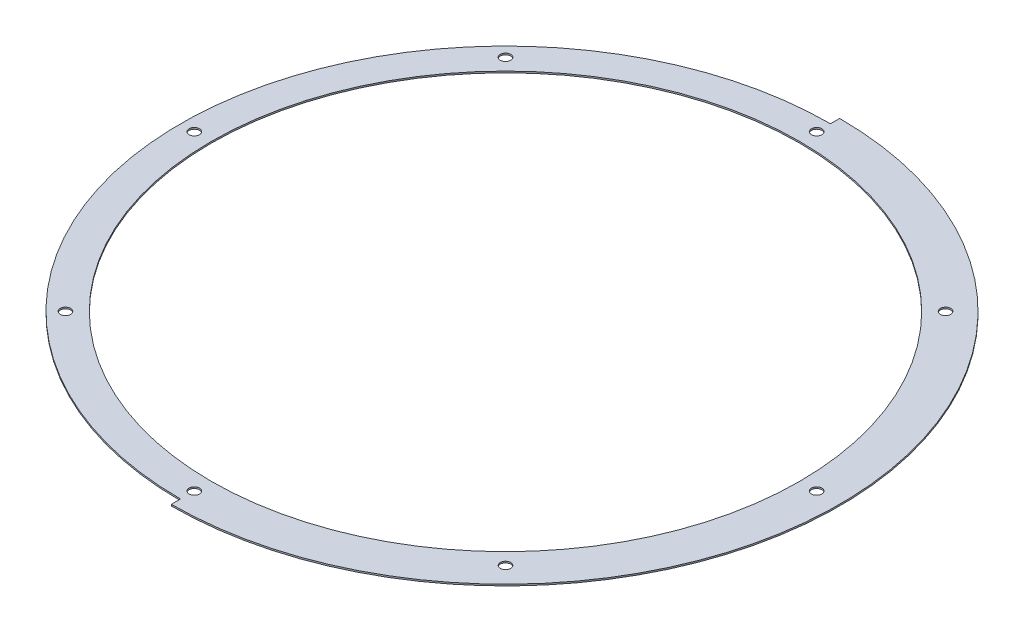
from build123d import *

# Parameters (mm, degrees)
SKETCH1_R                         = 121.92
BOSS_EXTRUDE1_DEPTH               = 0.635
M4_CLEARANCE_5MM_DOWEL_PIN_HOLE_D = 4.3
CIRPATTERN1_COUNT                 = 8
ROUND_EDGES_R                     = 0.127


with BuildPart() as part:
    # Sketch1 → Boss-Extrude1 (new body)
    with BuildSketch(Plane(origin=(0, 0, 0), x_dir=(1, 0, 0), z_dir=(0, 1, 0))):
        with BuildLine():
            Line((0, 134.62), (0, 138.43))
            ThreePointArc((0, 138.43), (138.43, 0), (0, -138.43))
            Line((0, -138.43), (0, -134.62))
            ThreePointArc((0, -134.62), (-134.62, 0), (0, 134.62))
        make_face()
        with Locations(Location((0, 0, 0), (0, 0, 270))):
            Circle(SKETCH1_R, mode=Mode.SUBTRACT)
    extrude(amount=BOSS_EXTRUDE1_DEPTH)

    # M4 Clearance _ 5mm Dowel Pin Hole (through all)
    with Locations(Plane(origin=(0, 0.635, 0), x_dir=(1, 0, 0), z_dir=(0, 1, 0))):
        with Locations((0, -128.905)):
            m4_clearance_5mm_dowel_pin_hole = Hole(M4_CLEARANCE_5MM_DOWEL_PIN_HOLE_D / 2)

    # CirPattern1: M4 Clearance _ 5mm Dowel Pin Hole ×8 about axis
    cirpattern1_axis = Axis((0, 0, 0), (0, 1, 0))
    for i in range(1, CIRPATTERN1_COUNT):
        add(m4_clearance_5mm_dowel_pin_hole.rotate(cirpattern1_axis, i * 360 / CIRPATTERN1_COUNT), mode=Mode.SUBTRACT)

    # Round Edges
    round_edges_edges = [part.edges().sort_by_distance(p)[0] for p in [
        (0, 0.3175, -134.62),
        (0, 0.3175, -138.43),
        (0, 0.3175, 138.43),
        (0, 0.3175, 134.62),
    ]]
    fillet(round_edges_edges, radius=ROUND_EDGES_R)


solid = part.part
